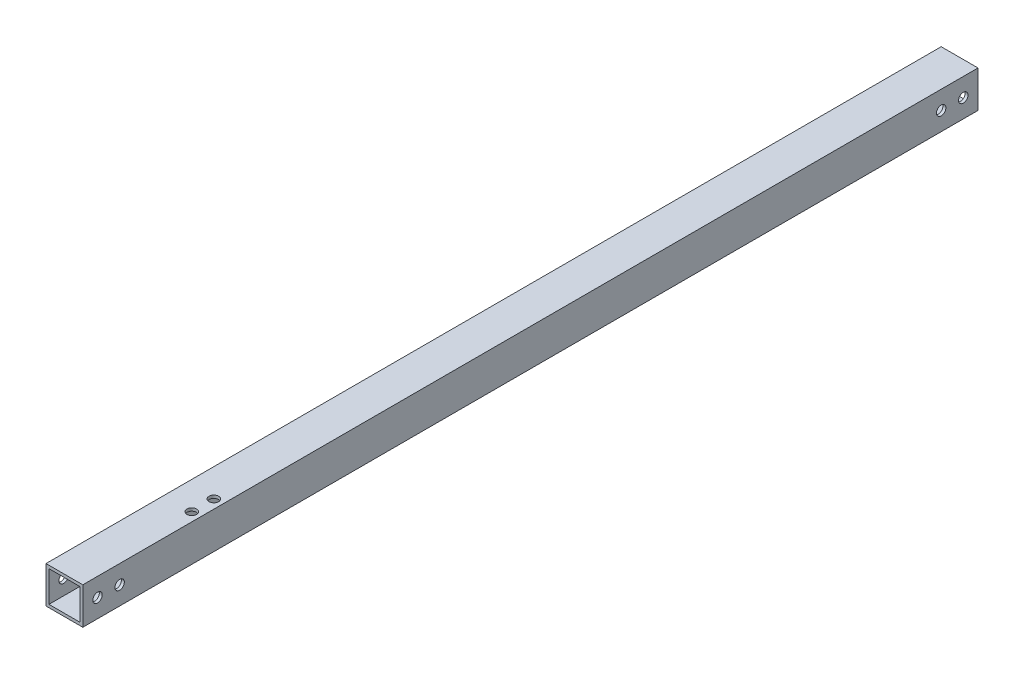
ISO-10303-21;
HEADER;
FILE_DESCRIPTION(('STEP AP214'),'2;1');
FILE_NAME('part.step','',(''),(''),'','','');
FILE_SCHEMA(('AUTOMOTIVE_DESIGN { 1 0 10303 214 1 1 1 1 }'));
ENDSEC;
DATA;
#1=APPLICATION_CONTEXT('core data for automotive mechanical design processes');
#2=APPLICATION_PROTOCOL_DEFINITION('international standard','automotive_design',2000,#1);
#3=PRODUCT_CONTEXT('',#1,'mechanical');
#4=PRODUCT('Part','Part','',(#3));
#5=PRODUCT_RELATED_PRODUCT_CATEGORY('part','',(#4));
#6=PRODUCT_DEFINITION_FORMATION('','',#4);
#7=PRODUCT_DEFINITION_CONTEXT('part definition',#1,'design');
#8=PRODUCT_DEFINITION('design','',#6,#7);
#9=PRODUCT_DEFINITION_SHAPE('','',#8);
#10=(LENGTH_UNIT() NAMED_UNIT(*) SI_UNIT(.MILLI.,.METRE.));
#11=(NAMED_UNIT(*) PLANE_ANGLE_UNIT() SI_UNIT($,.RADIAN.));
#12=(NAMED_UNIT(*) SI_UNIT($,.STERADIAN.) SOLID_ANGLE_UNIT());
#13=UNCERTAINTY_MEASURE_WITH_UNIT(LENGTH_MEASURE(1.E-05),#10,'distance_accuracy_value','');
#14=(GEOMETRIC_REPRESENTATION_CONTEXT(3) GLOBAL_UNCERTAINTY_ASSIGNED_CONTEXT((#13)) GLOBAL_UNIT_ASSIGNED_CONTEXT((#10,
#11,#12)) REPRESENTATION_CONTEXT('',''));
#15=CARTESIAN_POINT('',(0.,0.,0.));
#16=DIRECTION('',(0.,0.,1.));
#17=DIRECTION('',(1.,0.,0.));
#18=AXIS2_PLACEMENT_3D('',#15,#16,#17);
#19=CARTESIAN_POINT('',(12.5,12.5,-608.));
#20=DIRECTION('',(1.,0.,0.));
#21=DIRECTION('',(0.,1.,0.));
#22=AXIS2_PLACEMENT_3D('',#19,#20,#21);
#23=PLANE('',#22);
#24=CARTESIAN_POINT('',(12.5,0.,-598.));
#25=DIRECTION('',(-1.,0.,0.));
#26=DIRECTION('',(0.,-1.,0.));
#27=AXIS2_PLACEMENT_3D('',#24,#25,#26);
#28=CIRCLE('',#27,3.19999999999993);
#29=CARTESIAN_POINT('',(12.5,-3.19999999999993,-598.));
#30=VERTEX_POINT('',#29);
#31=EDGE_CURVE('E201',#30,#30,#28,.T.);
#32=ORIENTED_EDGE('',*,*,#31,.T.);
#33=EDGE_LOOP('',(#32));
#34=FACE_BOUND('',#33,.T.);
#35=CARTESIAN_POINT('',(12.5,0.,-25.));
#36=DIRECTION('',(-1.,0.,0.));
#37=DIRECTION('',(0.,-1.,0.));
#38=AXIS2_PLACEMENT_3D('',#35,#36,#37);
#39=CIRCLE('',#38,3.2);
#40=CARTESIAN_POINT('',(12.5,-3.2,-25.));
#41=VERTEX_POINT('',#40);
#42=EDGE_CURVE('E258',#41,#41,#39,.T.);
#43=ORIENTED_EDGE('',*,*,#42,.T.);
#44=EDGE_LOOP('',(#43));
#45=FACE_BOUND('',#44,.T.);
#46=CARTESIAN_POINT('',(12.5,0.,-10.));
#47=DIRECTION('',(-1.,0.,0.));
#48=DIRECTION('',(0.,-1.,0.));
#49=AXIS2_PLACEMENT_3D('',#46,#47,#48);
#50=CIRCLE('',#49,3.2);
#51=CARTESIAN_POINT('',(12.5,-3.2,-10.));
#52=VERTEX_POINT('',#51);
#53=EDGE_CURVE('E273',#52,#52,#50,.T.);
#54=ORIENTED_EDGE('',*,*,#53,.T.);
#55=EDGE_LOOP('',(#54));
#56=FACE_BOUND('',#55,.T.);
#57=CARTESIAN_POINT('',(12.5,0.,-583.));
#58=DIRECTION('',(-1.,0.,0.));
#59=DIRECTION('',(0.,-1.,0.));
#60=AXIS2_PLACEMENT_3D('',#57,#58,#59);
#61=CIRCLE('',#60,3.19999999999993);
#62=CARTESIAN_POINT('',(12.5,-3.19999999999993,-583.));
#63=VERTEX_POINT('',#62);
#64=EDGE_CURVE('E257',#63,#63,#61,.T.);
#65=ORIENTED_EDGE('',*,*,#64,.T.);
#66=EDGE_LOOP('',(#65));
#67=FACE_BOUND('',#66,.T.);
#68=DIRECTION('',(0.,1.,0.));
#69=VECTOR('',#68,1.);
#70=CARTESIAN_POINT('',(12.5,12.5,0.));
#71=LINE('',#70,#69);
#72=CARTESIAN_POINT('',(12.5,-12.5,0.));
#73=VERTEX_POINT('',#72);
#74=CARTESIAN_POINT('',(12.5,12.5,0.));
#75=VERTEX_POINT('',#74);
#76=EDGE_CURVE('E151',#73,#75,#71,.T.);
#77=ORIENTED_EDGE('',*,*,#76,.F.);
#78=DIRECTION('',(0.,0.,1.));
#79=VECTOR('',#78,1.);
#80=CARTESIAN_POINT('',(12.5,-12.5,-608.));
#81=LINE('',#80,#79);
#82=CARTESIAN_POINT('',(12.5,-12.5,-608.));
#83=VERTEX_POINT('',#82);
#84=EDGE_CURVE('E11',#83,#73,#81,.T.);
#85=ORIENTED_EDGE('',*,*,#84,.F.);
#86=DIRECTION('',(0.,1.,0.));
#87=VECTOR('',#86,1.);
#88=CARTESIAN_POINT('',(12.5,12.5,-608.));
#89=LINE('',#88,#87);
#90=CARTESIAN_POINT('',(12.5,12.5,-608.));
#91=VERTEX_POINT('',#90);
#92=EDGE_CURVE('E157',#83,#91,#89,.T.);
#93=ORIENTED_EDGE('',*,*,#92,.T.);
#94=DIRECTION('',(0.,0.,1.));
#95=VECTOR('',#94,1.);
#96=CARTESIAN_POINT('',(12.5,12.5,-608.));
#97=LINE('',#96,#95);
#98=EDGE_CURVE('E174',#91,#75,#97,.T.);
#99=ORIENTED_EDGE('',*,*,#98,.T.);
#100=EDGE_LOOP('',(#77,#85,#93,#99));
#101=FACE_BOUND('',#100,.T.);
#102=ADVANCED_FACE('F38',(#34,#45,#56,#67,#101),#23,.T.);
#103=CARTESIAN_POINT('',(-12.5,-12.5,-608.));
#104=DIRECTION('',(0.,-1.,0.));
#105=DIRECTION('',(0.,0.,-1.));
#106=AXIS2_PLACEMENT_3D('',#103,#104,#105);
#107=PLANE('',#106);
#108=CARTESIAN_POINT('',(6.5,-12.5,-95.));
#109=DIRECTION('',(0.,-1.,0.));
#110=DIRECTION('',(0.,0.,-1.));
#111=AXIS2_PLACEMENT_3D('',#108,#109,#110);
#112=CIRCLE('',#111,3.25);
#113=CARTESIAN_POINT('',(6.5,-12.5,-98.25));
#114=VERTEX_POINT('',#113);
#115=EDGE_CURVE('E219',#114,#114,#112,.T.);
#116=ORIENTED_EDGE('',*,*,#115,.F.);
#117=EDGE_LOOP('',(#116));
#118=FACE_BOUND('',#117,.T.);
#119=CARTESIAN_POINT('',(6.5,-12.5,-80.));
#120=DIRECTION('',(0.,-1.,0.));
#121=DIRECTION('',(0.,0.,-1.));
#122=AXIS2_PLACEMENT_3D('',#119,#120,#121);
#123=CIRCLE('',#122,3.25);
#124=CARTESIAN_POINT('',(6.5,-12.5,-83.25));
#125=VERTEX_POINT('',#124);
#126=EDGE_CURVE('E229',#125,#125,#123,.T.);
#127=ORIENTED_EDGE('',*,*,#126,.F.);
#128=EDGE_LOOP('',(#127));
#129=FACE_BOUND('',#128,.T.);
#130=DIRECTION('',(1.,0.,0.));
#131=VECTOR('',#130,1.);
#132=CARTESIAN_POINT('',(-12.5,-12.5,0.));
#133=LINE('',#132,#131);
#134=CARTESIAN_POINT('',(-12.5,-12.5,0.));
#135=VERTEX_POINT('',#134);
#136=EDGE_CURVE('E162',#135,#73,#133,.T.);
#137=ORIENTED_EDGE('',*,*,#136,.F.);
#138=DIRECTION('',(0.,0.,1.));
#139=VECTOR('',#138,1.);
#140=CARTESIAN_POINT('',(-12.5,-12.5,-608.));
#141=LINE('',#140,#139);
#142=CARTESIAN_POINT('',(-12.5,-12.5,-608.));
#143=VERTEX_POINT('',#142);
#144=EDGE_CURVE('E47',#143,#135,#141,.T.);
#145=ORIENTED_EDGE('',*,*,#144,.F.);
#146=DIRECTION('',(1.,0.,0.));
#147=VECTOR('',#146,1.);
#148=CARTESIAN_POINT('',(-12.5,-12.5,-608.));
#149=LINE('',#148,#147);
#150=EDGE_CURVE('E170',#143,#83,#149,.T.);
#151=ORIENTED_EDGE('',*,*,#150,.T.);
#152=ORIENTED_EDGE('',*,*,#84,.T.);
#153=EDGE_LOOP('',(#137,#145,#151,#152));
#154=FACE_BOUND('',#153,.T.);
#155=ADVANCED_FACE('F315',(#118,#129,#154),#107,.T.);
#156=CARTESIAN_POINT('',(-12.5,12.5,-608.));
#157=DIRECTION('',(-1.,0.,0.));
#158=DIRECTION('',(0.,-1.,0.));
#159=AXIS2_PLACEMENT_3D('',#156,#157,#158);
#160=PLANE('',#159);
#161=CARTESIAN_POINT('',(-12.5,0.,-598.));
#162=DIRECTION('',(-1.,0.,0.));
#163=DIRECTION('',(0.,-1.,0.));
#164=AXIS2_PLACEMENT_3D('',#161,#162,#163);
#165=CIRCLE('',#164,3.19999999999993);
#166=CARTESIAN_POINT('',(-12.5,-3.19999999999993,-598.));
#167=VERTEX_POINT('',#166);
#168=EDGE_CURVE('E253',#167,#167,#165,.T.);
#169=ORIENTED_EDGE('',*,*,#168,.F.);
#170=EDGE_LOOP('',(#169));
#171=FACE_BOUND('',#170,.T.);
#172=CARTESIAN_POINT('',(-12.5,0.,-25.));
#173=DIRECTION('',(-1.,0.,0.));
#174=DIRECTION('',(0.,-1.,0.));
#175=AXIS2_PLACEMENT_3D('',#172,#173,#174);
#176=CIRCLE('',#175,3.2);
#177=CARTESIAN_POINT('',(-12.5,-3.20000000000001,-25.));
#178=VERTEX_POINT('',#177);
#179=EDGE_CURVE('E249',#178,#178,#176,.T.);
#180=ORIENTED_EDGE('',*,*,#179,.F.);
#181=EDGE_LOOP('',(#180));
#182=FACE_BOUND('',#181,.T.);
#183=CARTESIAN_POINT('',(-12.5,0.,-10.));
#184=DIRECTION('',(-1.,0.,0.));
#185=DIRECTION('',(0.,-1.,0.));
#186=AXIS2_PLACEMENT_3D('',#183,#184,#185);
#187=CIRCLE('',#186,3.2);
#188=CARTESIAN_POINT('',(-12.5,-3.20000000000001,-10.));
#189=VERTEX_POINT('',#188);
#190=EDGE_CURVE('E262',#189,#189,#187,.T.);
#191=ORIENTED_EDGE('',*,*,#190,.F.);
#192=EDGE_LOOP('',(#191));
#193=FACE_BOUND('',#192,.T.);
#194=CARTESIAN_POINT('',(-12.5,0.,-583.));
#195=DIRECTION('',(-1.,0.,0.));
#196=DIRECTION('',(0.,-1.,0.));
#197=AXIS2_PLACEMENT_3D('',#194,#195,#196);
#198=CIRCLE('',#197,3.19999999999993);
#199=CARTESIAN_POINT('',(-12.5,-3.19999999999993,-583.));
#200=VERTEX_POINT('',#199);
#201=EDGE_CURVE('E269',#200,#200,#198,.T.);
#202=ORIENTED_EDGE('',*,*,#201,.F.);
#203=EDGE_LOOP('',(#202));
#204=FACE_BOUND('',#203,.T.);
#205=DIRECTION('',(0.,-1.,0.));
#206=VECTOR('',#205,1.);
#207=CARTESIAN_POINT('',(-12.5,12.5,0.));
#208=LINE('',#207,#206);
#209=CARTESIAN_POINT('',(-12.5,12.5,0.));
#210=VERTEX_POINT('',#209);
#211=EDGE_CURVE('E182',#210,#135,#208,.T.);
#212=ORIENTED_EDGE('',*,*,#211,.F.);
#213=DIRECTION('',(0.,0.,1.));
#214=VECTOR('',#213,1.);
#215=CARTESIAN_POINT('',(-12.5,12.5,-608.));
#216=LINE('',#215,#214);
#217=CARTESIAN_POINT('',(-12.5,12.5,-608.));
#218=VERTEX_POINT('',#217);
#219=EDGE_CURVE('E191',#218,#210,#216,.T.);
#220=ORIENTED_EDGE('',*,*,#219,.F.);
#221=DIRECTION('',(0.,-1.,0.));
#222=VECTOR('',#221,1.);
#223=CARTESIAN_POINT('',(-12.5,12.5,-608.));
#224=LINE('',#223,#222);
#225=EDGE_CURVE('E166',#218,#143,#224,.T.);
#226=ORIENTED_EDGE('',*,*,#225,.T.);
#227=ORIENTED_EDGE('',*,*,#144,.T.);
#228=EDGE_LOOP('',(#212,#220,#226,#227));
#229=FACE_BOUND('',#228,.T.);
#230=ADVANCED_FACE('F320',(#171,#182,#193,#204,#229),#160,.T.);
#231=CARTESIAN_POINT('',(-12.5,12.5,-608.));
#232=DIRECTION('',(0.,1.,0.));
#233=DIRECTION('',(0.,0.,1.));
#234=AXIS2_PLACEMENT_3D('',#231,#232,#233);
#235=PLANE('',#234);
#236=CARTESIAN_POINT('',(6.5,12.5,-95.));
#237=DIRECTION('',(0.,1.,0.));
#238=DIRECTION('',(0.,0.,1.));
#239=AXIS2_PLACEMENT_3D('',#236,#237,#238);
#240=CIRCLE('',#239,3.25);
#241=CARTESIAN_POINT('',(6.5,12.5,-91.75));
#242=VERTEX_POINT('',#241);
#243=EDGE_CURVE('E245',#242,#242,#240,.T.);
#244=ORIENTED_EDGE('',*,*,#243,.F.);
#245=EDGE_LOOP('',(#244));
#246=FACE_BOUND('',#245,.T.);
#247=CARTESIAN_POINT('',(6.5,12.5,-80.));
#248=DIRECTION('',(0.,1.,0.));
#249=DIRECTION('',(0.,0.,1.));
#250=AXIS2_PLACEMENT_3D('',#247,#248,#249);
#251=CIRCLE('',#250,3.25);
#252=CARTESIAN_POINT('',(6.5,12.5,-76.75));
#253=VERTEX_POINT('',#252);
#254=EDGE_CURVE('E226',#253,#253,#251,.T.);
#255=ORIENTED_EDGE('',*,*,#254,.F.);
#256=EDGE_LOOP('',(#255));
#257=FACE_BOUND('',#256,.T.);
#258=DIRECTION('',(-1.,0.,0.));
#259=VECTOR('',#258,1.);
#260=CARTESIAN_POINT('',(-12.5,12.5,0.));
#261=LINE('',#260,#259);
#262=EDGE_CURVE('E178',#75,#210,#261,.T.);
#263=ORIENTED_EDGE('',*,*,#262,.F.);
#264=ORIENTED_EDGE('',*,*,#98,.F.);
#265=DIRECTION('',(-1.,0.,0.));
#266=VECTOR('',#265,1.);
#267=CARTESIAN_POINT('',(-12.5,12.5,-608.));
#268=LINE('',#267,#266);
#269=EDGE_CURVE('E161',#91,#218,#268,.T.);
#270=ORIENTED_EDGE('',*,*,#269,.T.);
#271=ORIENTED_EDGE('',*,*,#219,.T.);
#272=EDGE_LOOP('',(#263,#264,#270,#271));
#273=FACE_BOUND('',#272,.T.);
#274=ADVANCED_FACE('F343',(#246,#257,#273),#235,.T.);
#275=CARTESIAN_POINT('',(0.,0.,-608.));
#276=DIRECTION('',(0.,0.,1.));
#277=DIRECTION('',(1.,0.,0.));
#278=AXIS2_PLACEMENT_3D('',#275,#276,#277);
#279=PLANE('',#278);
#280=DIRECTION('',(-1.,0.,0.));
#281=VECTOR('',#280,1.);
#282=CARTESIAN_POINT('',(-10.5,10.5,-608.));
#283=LINE('',#282,#281);
#284=CARTESIAN_POINT('',(10.5,10.5,-608.));
#285=VERTEX_POINT('',#284);
#286=CARTESIAN_POINT('',(-10.5,10.5,-608.));
#287=VERTEX_POINT('',#286);
#288=EDGE_CURVE('E113',#285,#287,#283,.T.);
#289=ORIENTED_EDGE('',*,*,#288,.T.);
#290=DIRECTION('',(0.,-1.,0.));
#291=VECTOR('',#290,1.);
#292=CARTESIAN_POINT('',(-10.5,10.5,-608.));
#293=LINE('',#292,#291);
#294=CARTESIAN_POINT('',(-10.5,-10.5,-608.));
#295=VERTEX_POINT('',#294);
#296=EDGE_CURVE('E106',#287,#295,#293,.T.);
#297=ORIENTED_EDGE('',*,*,#296,.T.);
#298=DIRECTION('',(1.,0.,0.));
#299=VECTOR('',#298,1.);
#300=CARTESIAN_POINT('',(-10.5,-10.5,-608.));
#301=LINE('',#300,#299);
#302=CARTESIAN_POINT('',(10.5,-10.5,-608.));
#303=VERTEX_POINT('',#302);
#304=EDGE_CURVE('E116',#295,#303,#301,.T.);
#305=ORIENTED_EDGE('',*,*,#304,.T.);
#306=DIRECTION('',(0.,1.,0.));
#307=VECTOR('',#306,1.);
#308=CARTESIAN_POINT('',(10.5,10.5,-608.));
#309=LINE('',#308,#307);
#310=EDGE_CURVE('E55',#303,#285,#309,.T.);
#311=ORIENTED_EDGE('',*,*,#310,.T.);
#312=EDGE_LOOP('',(#289,#297,#305,#311));
#313=FACE_BOUND('',#312,.T.);
#314=ORIENTED_EDGE('',*,*,#92,.F.);
#315=ORIENTED_EDGE('',*,*,#150,.F.);
#316=ORIENTED_EDGE('',*,*,#225,.F.);
#317=ORIENTED_EDGE('',*,*,#269,.F.);
#318=EDGE_LOOP('',(#314,#315,#316,#317));
#319=FACE_BOUND('',#318,.T.);
#320=ADVANCED_FACE('F121',(#313,#319),#279,.F.);
#321=CARTESIAN_POINT('',(0.,0.,0.));
#322=DIRECTION('',(0.,0.,1.));
#323=DIRECTION('',(1.,0.,0.));
#324=AXIS2_PLACEMENT_3D('',#321,#322,#323);
#325=PLANE('',#324);
#326=DIRECTION('',(0.,-1.,0.));
#327=VECTOR('',#326,1.);
#328=CARTESIAN_POINT('',(-10.5,10.5,0.));
#329=LINE('',#328,#327);
#330=CARTESIAN_POINT('',(-10.5,10.5,0.));
#331=VERTEX_POINT('',#330);
#332=CARTESIAN_POINT('',(-10.5,-10.5,0.));
#333=VERTEX_POINT('',#332);
#334=EDGE_CURVE('E63',#331,#333,#329,.T.);
#335=ORIENTED_EDGE('',*,*,#334,.F.);
#336=DIRECTION('',(-1.,0.,0.));
#337=VECTOR('',#336,1.);
#338=CARTESIAN_POINT('',(-10.5,10.5,0.));
#339=LINE('',#338,#337);
#340=CARTESIAN_POINT('',(10.5,10.5,0.));
#341=VERTEX_POINT('',#340);
#342=EDGE_CURVE('E125',#341,#331,#339,.T.);
#343=ORIENTED_EDGE('',*,*,#342,.F.);
#344=DIRECTION('',(0.,1.,0.));
#345=VECTOR('',#344,1.);
#346=CARTESIAN_POINT('',(10.5,10.5,0.));
#347=LINE('',#346,#345);
#348=CARTESIAN_POINT('',(10.5,-10.5,0.));
#349=VERTEX_POINT('',#348);
#350=EDGE_CURVE('E130',#349,#341,#347,.T.);
#351=ORIENTED_EDGE('',*,*,#350,.F.);
#352=DIRECTION('',(1.,0.,0.));
#353=VECTOR('',#352,1.);
#354=CARTESIAN_POINT('',(-10.5,-10.5,0.));
#355=LINE('',#354,#353);
#356=EDGE_CURVE('E142',#333,#349,#355,.T.);
#357=ORIENTED_EDGE('',*,*,#356,.F.);
#358=EDGE_LOOP('',(#335,#343,#351,#357));
#359=FACE_BOUND('',#358,.T.);
#360=ORIENTED_EDGE('',*,*,#76,.T.);
#361=ORIENTED_EDGE('',*,*,#262,.T.);
#362=ORIENTED_EDGE('',*,*,#211,.T.);
#363=ORIENTED_EDGE('',*,*,#136,.T.);
#364=EDGE_LOOP('',(#360,#361,#362,#363));
#365=FACE_BOUND('',#364,.T.);
#366=ADVANCED_FACE('F336',(#359,#365),#325,.T.);
#367=CARTESIAN_POINT('',(-10.5,10.5,-608.));
#368=DIRECTION('',(-1.,0.,0.));
#369=DIRECTION('',(0.,-1.,0.));
#370=AXIS2_PLACEMENT_3D('',#367,#368,#369);
#371=PLANE('',#370);
#372=CARTESIAN_POINT('',(-10.5,0.,-598.));
#373=DIRECTION('',(-1.,0.,0.));
#374=DIRECTION('',(0.,-1.,0.));
#375=AXIS2_PLACEMENT_3D('',#372,#373,#374);
#376=CIRCLE('',#375,3.19999999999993);
#377=CARTESIAN_POINT('',(-10.5,-3.19999999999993,-598.));
#378=VERTEX_POINT('',#377);
#379=EDGE_CURVE('E133',#378,#378,#376,.T.);
#380=ORIENTED_EDGE('',*,*,#379,.T.);
#381=EDGE_LOOP('',(#380));
#382=FACE_BOUND('',#381,.T.);
#383=CARTESIAN_POINT('',(-10.5,0.,-25.));
#384=DIRECTION('',(-1.,0.,0.));
#385=DIRECTION('',(0.,-1.,0.));
#386=AXIS2_PLACEMENT_3D('',#383,#384,#385);
#387=CIRCLE('',#386,3.2);
#388=CARTESIAN_POINT('',(-10.5,-3.20000000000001,-25.));
#389=VERTEX_POINT('',#388);
#390=EDGE_CURVE('E211',#389,#389,#387,.T.);
#391=ORIENTED_EDGE('',*,*,#390,.T.);
#392=EDGE_LOOP('',(#391));
#393=FACE_BOUND('',#392,.T.);
#394=CARTESIAN_POINT('',(-10.5,0.,-10.));
#395=DIRECTION('',(-1.,0.,0.));
#396=DIRECTION('',(0.,-1.,0.));
#397=AXIS2_PLACEMENT_3D('',#394,#395,#396);
#398=CIRCLE('',#397,3.2);
#399=CARTESIAN_POINT('',(-10.5,-3.20000000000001,-10.));
#400=VERTEX_POINT('',#399);
#401=EDGE_CURVE('E206',#400,#400,#398,.T.);
#402=ORIENTED_EDGE('',*,*,#401,.T.);
#403=EDGE_LOOP('',(#402));
#404=FACE_BOUND('',#403,.T.);
#405=CARTESIAN_POINT('',(-10.5,0.,-583.));
#406=DIRECTION('',(-1.,0.,0.));
#407=DIRECTION('',(0.,-1.,0.));
#408=AXIS2_PLACEMENT_3D('',#405,#406,#407);
#409=CIRCLE('',#408,3.19999999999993);
#410=CARTESIAN_POINT('',(-10.5,-3.19999999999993,-583.));
#411=VERTEX_POINT('',#410);
#412=EDGE_CURVE('E200',#411,#411,#409,.T.);
#413=ORIENTED_EDGE('',*,*,#412,.T.);
#414=EDGE_LOOP('',(#413));
#415=FACE_BOUND('',#414,.T.);
#416=ORIENTED_EDGE('',*,*,#334,.T.);
#417=DIRECTION('',(0.,0.,1.));
#418=VECTOR('',#417,1.);
#419=CARTESIAN_POINT('',(-10.5,-10.5,-608.));
#420=LINE('',#419,#418);
#421=EDGE_CURVE('E102',#295,#333,#420,.T.);
#422=ORIENTED_EDGE('',*,*,#421,.F.);
#423=ORIENTED_EDGE('',*,*,#296,.F.);
#424=DIRECTION('',(0.,0.,1.));
#425=VECTOR('',#424,1.);
#426=CARTESIAN_POINT('',(-10.5,10.5,-608.));
#427=LINE('',#426,#425);
#428=EDGE_CURVE('E148',#287,#331,#427,.T.);
#429=ORIENTED_EDGE('',*,*,#428,.T.);
#430=EDGE_LOOP('',(#416,#422,#423,#429));
#431=FACE_BOUND('',#430,.T.);
#432=ADVANCED_FACE('F104',(#382,#393,#404,#415,#431),#371,.F.);
#433=CARTESIAN_POINT('',(-10.5,10.5,-608.));
#434=DIRECTION('',(0.,1.,0.));
#435=DIRECTION('',(0.,0.,1.));
#436=AXIS2_PLACEMENT_3D('',#433,#434,#435);
#437=PLANE('',#436);
#438=CARTESIAN_POINT('',(6.5,10.5,-95.));
#439=DIRECTION('',(0.,1.,0.));
#440=DIRECTION('',(0.,0.,1.));
#441=AXIS2_PLACEMENT_3D('',#438,#439,#440);
#442=CIRCLE('',#441,3.25);
#443=CARTESIAN_POINT('',(6.5,10.5,-91.75));
#444=VERTEX_POINT('',#443);
#445=EDGE_CURVE('E241',#444,#444,#442,.T.);
#446=ORIENTED_EDGE('',*,*,#445,.T.);
#447=EDGE_LOOP('',(#446));
#448=FACE_BOUND('',#447,.T.);
#449=CARTESIAN_POINT('',(6.5,10.5,-80.));
#450=DIRECTION('',(0.,1.,0.));
#451=DIRECTION('',(0.,0.,1.));
#452=AXIS2_PLACEMENT_3D('',#449,#450,#451);
#453=CIRCLE('',#452,3.25);
#454=CARTESIAN_POINT('',(6.5,10.5,-76.75));
#455=VERTEX_POINT('',#454);
#456=EDGE_CURVE('E218',#455,#455,#453,.T.);
#457=ORIENTED_EDGE('',*,*,#456,.T.);
#458=EDGE_LOOP('',(#457));
#459=FACE_BOUND('',#458,.T.);
#460=ORIENTED_EDGE('',*,*,#342,.T.);
#461=ORIENTED_EDGE('',*,*,#428,.F.);
#462=ORIENTED_EDGE('',*,*,#288,.F.);
#463=DIRECTION('',(0.,0.,1.));
#464=VECTOR('',#463,1.);
#465=CARTESIAN_POINT('',(10.5,10.5,-608.));
#466=LINE('',#465,#464);
#467=EDGE_CURVE('E152',#285,#341,#466,.T.);
#468=ORIENTED_EDGE('',*,*,#467,.T.);
#469=EDGE_LOOP('',(#460,#461,#462,#468));
#470=FACE_BOUND('',#469,.T.);
#471=ADVANCED_FACE('F362',(#448,#459,#470),#437,.F.);
#472=CARTESIAN_POINT('',(10.5,10.5,-608.));
#473=DIRECTION('',(1.,0.,0.));
#474=DIRECTION('',(0.,1.,0.));
#475=AXIS2_PLACEMENT_3D('',#472,#473,#474);
#476=PLANE('',#475);
#477=CARTESIAN_POINT('',(10.5,0.,-598.));
#478=DIRECTION('',(1.,0.,0.));
#479=DIRECTION('',(0.,1.,0.));
#480=AXIS2_PLACEMENT_3D('',#477,#478,#479);
#481=CIRCLE('',#480,3.19999999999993);
#482=CARTESIAN_POINT('',(10.5,3.19999999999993,-598.));
#483=VERTEX_POINT('',#482);
#484=EDGE_CURVE('E212',#483,#483,#481,.T.);
#485=ORIENTED_EDGE('',*,*,#484,.T.);
#486=EDGE_LOOP('',(#485));
#487=FACE_BOUND('',#486,.T.);
#488=CARTESIAN_POINT('',(10.5,0.,-25.));
#489=DIRECTION('',(1.,0.,0.));
#490=DIRECTION('',(0.,1.,0.));
#491=AXIS2_PLACEMENT_3D('',#488,#489,#490);
#492=CIRCLE('',#491,3.2);
#493=CARTESIAN_POINT('',(10.5,3.20000000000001,-25.));
#494=VERTEX_POINT('',#493);
#495=EDGE_CURVE('E207',#494,#494,#492,.T.);
#496=ORIENTED_EDGE('',*,*,#495,.T.);
#497=EDGE_LOOP('',(#496));
#498=FACE_BOUND('',#497,.T.);
#499=CARTESIAN_POINT('',(10.5,0.,-10.));
#500=DIRECTION('',(1.,0.,0.));
#501=DIRECTION('',(0.,1.,0.));
#502=AXIS2_PLACEMENT_3D('',#499,#500,#501);
#503=CIRCLE('',#502,3.2);
#504=CARTESIAN_POINT('',(10.5,3.20000000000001,-10.));
#505=VERTEX_POINT('',#504);
#506=EDGE_CURVE('E202',#505,#505,#503,.T.);
#507=ORIENTED_EDGE('',*,*,#506,.T.);
#508=EDGE_LOOP('',(#507));
#509=FACE_BOUND('',#508,.T.);
#510=CARTESIAN_POINT('',(10.5,0.,-583.));
#511=DIRECTION('',(1.,0.,0.));
#512=DIRECTION('',(0.,1.,0.));
#513=AXIS2_PLACEMENT_3D('',#510,#511,#512);
#514=CIRCLE('',#513,3.19999999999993);
#515=CARTESIAN_POINT('',(10.5,3.19999999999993,-583.));
#516=VERTEX_POINT('',#515);
#517=EDGE_CURVE('E196',#516,#516,#514,.T.);
#518=ORIENTED_EDGE('',*,*,#517,.T.);
#519=EDGE_LOOP('',(#518));
#520=FACE_BOUND('',#519,.T.);
#521=ORIENTED_EDGE('',*,*,#350,.T.);
#522=ORIENTED_EDGE('',*,*,#467,.F.);
#523=ORIENTED_EDGE('',*,*,#310,.F.);
#524=DIRECTION('',(0.,0.,1.));
#525=VECTOR('',#524,1.);
#526=CARTESIAN_POINT('',(10.5,-10.5,-608.));
#527=LINE('',#526,#525);
#528=EDGE_CURVE('E112',#303,#349,#527,.T.);
#529=ORIENTED_EDGE('',*,*,#528,.T.);
#530=EDGE_LOOP('',(#521,#522,#523,#529));
#531=FACE_BOUND('',#530,.T.);
#532=ADVANCED_FACE('F367',(#487,#498,#509,#520,#531),#476,.F.);
#533=CARTESIAN_POINT('',(-10.5,-10.5,-608.));
#534=DIRECTION('',(0.,-1.,0.));
#535=DIRECTION('',(0.,0.,-1.));
#536=AXIS2_PLACEMENT_3D('',#533,#534,#535);
#537=PLANE('',#536);
#538=CARTESIAN_POINT('',(6.5,-10.5,-95.));
#539=DIRECTION('',(0.,-1.,0.));
#540=DIRECTION('',(0.,0.,-1.));
#541=AXIS2_PLACEMENT_3D('',#538,#539,#540);
#542=CIRCLE('',#541,3.25);
#543=CARTESIAN_POINT('',(6.5,-10.5,-98.25));
#544=VERTEX_POINT('',#543);
#545=EDGE_CURVE('E41',#544,#544,#542,.T.);
#546=ORIENTED_EDGE('',*,*,#545,.T.);
#547=EDGE_LOOP('',(#546));
#548=FACE_BOUND('',#547,.T.);
#549=CARTESIAN_POINT('',(6.5,-10.5,-80.));
#550=DIRECTION('',(0.,-1.,0.));
#551=DIRECTION('',(0.,0.,-1.));
#552=AXIS2_PLACEMENT_3D('',#549,#550,#551);
#553=CIRCLE('',#552,3.25);
#554=CARTESIAN_POINT('',(6.5,-10.5,-83.25));
#555=VERTEX_POINT('',#554);
#556=EDGE_CURVE('E215',#555,#555,#553,.T.);
#557=ORIENTED_EDGE('',*,*,#556,.T.);
#558=EDGE_LOOP('',(#557));
#559=FACE_BOUND('',#558,.T.);
#560=ORIENTED_EDGE('',*,*,#356,.T.);
#561=ORIENTED_EDGE('',*,*,#528,.F.);
#562=ORIENTED_EDGE('',*,*,#304,.F.);
#563=ORIENTED_EDGE('',*,*,#421,.T.);
#564=EDGE_LOOP('',(#560,#561,#562,#563));
#565=FACE_BOUND('',#564,.T.);
#566=ADVANCED_FACE('F117',(#548,#559,#565),#537,.F.);
#567=CARTESIAN_POINT('',(12.5,0.,-583.));
#568=DIRECTION('',(-1.,0.,0.));
#569=DIRECTION('',(0.,-1.,0.));
#570=AXIS2_PLACEMENT_3D('',#567,#568,#569);
#571=CYLINDRICAL_SURFACE('',#570,3.19999999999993);
#572=ORIENTED_EDGE('',*,*,#64,.F.);
#573=EDGE_LOOP('',(#572));
#574=FACE_BOUND('',#573,.T.);
#575=ORIENTED_EDGE('',*,*,#517,.F.);
#576=EDGE_LOOP('',(#575));
#577=FACE_BOUND('',#576,.T.);
#578=ADVANCED_FACE('F366',(#574,#577),#571,.F.);
#579=CARTESIAN_POINT('',(12.5,0.,-10.));
#580=DIRECTION('',(-1.,0.,0.));
#581=DIRECTION('',(0.,-1.,0.));
#582=AXIS2_PLACEMENT_3D('',#579,#580,#581);
#583=CYLINDRICAL_SURFACE('',#582,3.2);
#584=ORIENTED_EDGE('',*,*,#53,.F.);
#585=EDGE_LOOP('',(#584));
#586=FACE_BOUND('',#585,.T.);
#587=ORIENTED_EDGE('',*,*,#506,.F.);
#588=EDGE_LOOP('',(#587));
#589=FACE_BOUND('',#588,.T.);
#590=ADVANCED_FACE('F310',(#586,#589),#583,.F.);
#591=CARTESIAN_POINT('',(12.5,0.,-25.));
#592=DIRECTION('',(-1.,0.,0.));
#593=DIRECTION('',(0.,-1.,0.));
#594=AXIS2_PLACEMENT_3D('',#591,#592,#593);
#595=CYLINDRICAL_SURFACE('',#594,3.2);
#596=ORIENTED_EDGE('',*,*,#42,.F.);
#597=EDGE_LOOP('',(#596));
#598=FACE_BOUND('',#597,.T.);
#599=ORIENTED_EDGE('',*,*,#495,.F.);
#600=EDGE_LOOP('',(#599));
#601=FACE_BOUND('',#600,.T.);
#602=ADVANCED_FACE('F298',(#598,#601),#595,.F.);
#603=CARTESIAN_POINT('',(12.5,0.,-598.));
#604=DIRECTION('',(-1.,0.,0.));
#605=DIRECTION('',(0.,-1.,0.));
#606=AXIS2_PLACEMENT_3D('',#603,#604,#605);
#607=CYLINDRICAL_SURFACE('',#606,3.19999999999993);
#608=ORIENTED_EDGE('',*,*,#31,.F.);
#609=EDGE_LOOP('',(#608));
#610=FACE_BOUND('',#609,.T.);
#611=ORIENTED_EDGE('',*,*,#484,.F.);
#612=EDGE_LOOP('',(#611));
#613=FACE_BOUND('',#612,.T.);
#614=ADVANCED_FACE('F306',(#610,#613),#607,.F.);
#615=ORIENTED_EDGE('',*,*,#201,.T.);
#616=EDGE_LOOP('',(#615));
#617=FACE_BOUND('',#616,.T.);
#618=ORIENTED_EDGE('',*,*,#412,.F.);
#619=EDGE_LOOP('',(#618));
#620=FACE_BOUND('',#619,.T.);
#621=ADVANCED_FACE('F307',(#617,#620),#571,.F.);
#622=ORIENTED_EDGE('',*,*,#190,.T.);
#623=EDGE_LOOP('',(#622));
#624=FACE_BOUND('',#623,.T.);
#625=ORIENTED_EDGE('',*,*,#401,.F.);
#626=EDGE_LOOP('',(#625));
#627=FACE_BOUND('',#626,.T.);
#628=ADVANCED_FACE('F295',(#624,#627),#583,.F.);
#629=ORIENTED_EDGE('',*,*,#179,.T.);
#630=EDGE_LOOP('',(#629));
#631=FACE_BOUND('',#630,.T.);
#632=ORIENTED_EDGE('',*,*,#390,.F.);
#633=EDGE_LOOP('',(#632));
#634=FACE_BOUND('',#633,.T.);
#635=ADVANCED_FACE('F292',(#631,#634),#595,.F.);
#636=ORIENTED_EDGE('',*,*,#168,.T.);
#637=EDGE_LOOP('',(#636));
#638=FACE_BOUND('',#637,.T.);
#639=ORIENTED_EDGE('',*,*,#379,.F.);
#640=EDGE_LOOP('',(#639));
#641=FACE_BOUND('',#640,.T.);
#642=ADVANCED_FACE('F294',(#638,#641),#607,.F.);
#643=CARTESIAN_POINT('',(6.5,17.5,-80.));
#644=DIRECTION('',(0.,-1.,0.));
#645=DIRECTION('',(0.,0.,-1.));
#646=AXIS2_PLACEMENT_3D('',#643,#644,#645);
#647=CYLINDRICAL_SURFACE('',#646,3.25);
#648=ORIENTED_EDGE('',*,*,#126,.T.);
#649=EDGE_LOOP('',(#648));
#650=FACE_BOUND('',#649,.T.);
#651=ORIENTED_EDGE('',*,*,#556,.F.);
#652=EDGE_LOOP('',(#651));
#653=FACE_BOUND('',#652,.T.);
#654=ADVANCED_FACE('F303',(#650,#653),#647,.F.);
#655=CARTESIAN_POINT('',(6.5,17.5,-95.));
#656=DIRECTION('',(0.,-1.,0.));
#657=DIRECTION('',(0.,0.,-1.));
#658=AXIS2_PLACEMENT_3D('',#655,#656,#657);
#659=CYLINDRICAL_SURFACE('',#658,3.25);
#660=ORIENTED_EDGE('',*,*,#115,.T.);
#661=EDGE_LOOP('',(#660));
#662=FACE_BOUND('',#661,.T.);
#663=ORIENTED_EDGE('',*,*,#545,.F.);
#664=EDGE_LOOP('',(#663));
#665=FACE_BOUND('',#664,.T.);
#666=ADVANCED_FACE('F436',(#662,#665),#659,.F.);
#667=ORIENTED_EDGE('',*,*,#254,.T.);
#668=EDGE_LOOP('',(#667));
#669=FACE_BOUND('',#668,.T.);
#670=ORIENTED_EDGE('',*,*,#456,.F.);
#671=EDGE_LOOP('',(#670));
#672=FACE_BOUND('',#671,.T.);
#673=ADVANCED_FACE('F439',(#669,#672),#647,.F.);
#674=ORIENTED_EDGE('',*,*,#243,.T.);
#675=EDGE_LOOP('',(#674));
#676=FACE_BOUND('',#675,.T.);
#677=ORIENTED_EDGE('',*,*,#445,.F.);
#678=EDGE_LOOP('',(#677));
#679=FACE_BOUND('',#678,.T.);
#680=ADVANCED_FACE('F449',(#676,#679),#659,.F.);
#681=CLOSED_SHELL('',(#102,#155,#230,#274,#320,#366,#432,#471,#532,#566,#578,#590,#602,#614,
#621,#628,#635,#642,#654,#666,#673,#680));
#682=MANIFOLD_SOLID_BREP('B2',#681);
#683=ADVANCED_BREP_SHAPE_REPRESENTATION('',(#18,#682),#14);
#684=SHAPE_DEFINITION_REPRESENTATION(#9,#683);
ENDSEC;
END-ISO-10303-21;
